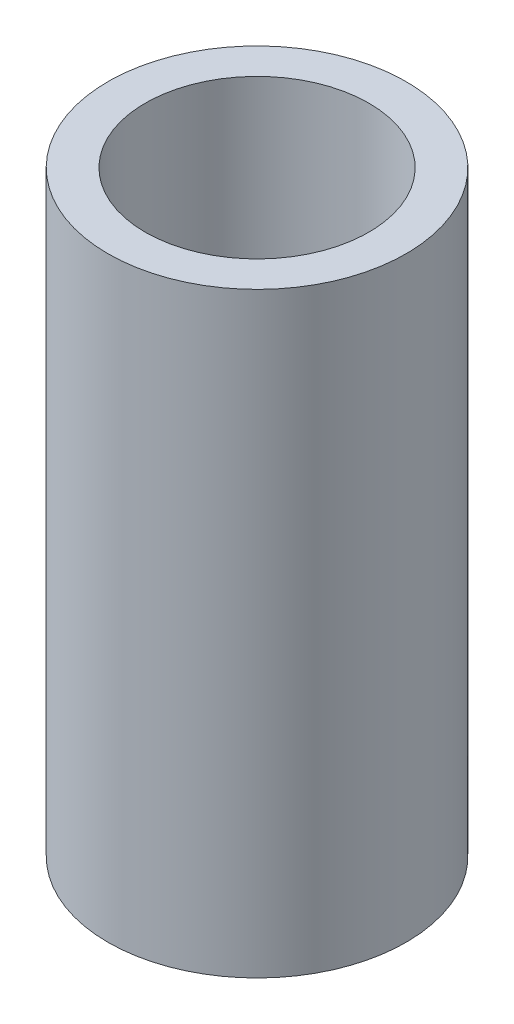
from build123d import *

# Parameters (mm, degrees)
SKETCH1_R   = 6.35
SKETCH1_R_2 = 4.7625


with BuildPart() as part:
    # Sweep1: sweep along a path in Sketch2
    with BuildLine(Plane.XY) as sweep1_path:
        Line((0, 0), (0, 25.4))
    # Sketch1 → Sweep1 (sweep)
    with BuildSketch(Plane(origin=(0, 0, 0), x_dir=(1, 0, 0), z_dir=(0, 1, 0))):
        Circle(SKETCH1_R)
        Circle(SKETCH1_R_2, mode=Mode.SUBTRACT)
    sweep(path=sweep1_path.line)


solid = part.part
